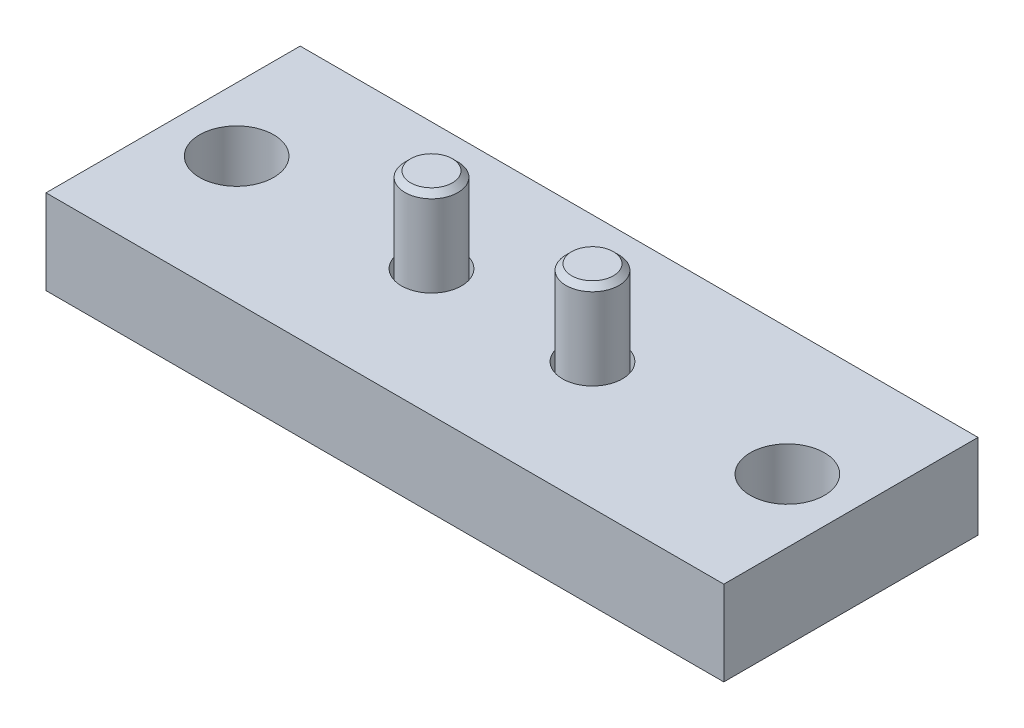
ISO-10303-21;
HEADER;
FILE_DESCRIPTION(('STEP AP214'),'2;1');
FILE_NAME('part.step','',(''),(''),'','','');
FILE_SCHEMA(('AUTOMOTIVE_DESIGN { 1 0 10303 214 1 1 1 1 }'));
ENDSEC;
DATA;
#1=APPLICATION_CONTEXT('core data for automotive mechanical design processes');
#2=APPLICATION_PROTOCOL_DEFINITION('international standard','automotive_design',2000,#1);
#3=PRODUCT_CONTEXT('',#1,'mechanical');
#4=PRODUCT('Part','Part','',(#3));
#5=PRODUCT_RELATED_PRODUCT_CATEGORY('part','',(#4));
#6=PRODUCT_DEFINITION_FORMATION('','',#4);
#7=PRODUCT_DEFINITION_CONTEXT('part definition',#1,'design');
#8=PRODUCT_DEFINITION('design','',#6,#7);
#9=PRODUCT_DEFINITION_SHAPE('','',#8);
#10=(LENGTH_UNIT() NAMED_UNIT(*) SI_UNIT(.MILLI.,.METRE.));
#11=(NAMED_UNIT(*) PLANE_ANGLE_UNIT() SI_UNIT($,.RADIAN.));
#12=(NAMED_UNIT(*) SI_UNIT($,.STERADIAN.) SOLID_ANGLE_UNIT());
#13=UNCERTAINTY_MEASURE_WITH_UNIT(LENGTH_MEASURE(1.E-05),#10,'distance_accuracy_value','');
#14=(GEOMETRIC_REPRESENTATION_CONTEXT(3) GLOBAL_UNCERTAINTY_ASSIGNED_CONTEXT((#13)) GLOBAL_UNIT_ASSIGNED_CONTEXT((#10,
#11,#12)) REPRESENTATION_CONTEXT('',''));
#15=CARTESIAN_POINT('',(0.,0.,0.));
#16=DIRECTION('',(0.,0.,1.));
#17=DIRECTION('',(1.,0.,0.));
#18=AXIS2_PLACEMENT_3D('',#15,#16,#17);
#19=CARTESIAN_POINT('',(8.93572,12.7,0.));
#20=DIRECTION('',(0.,1.,0.));
#21=DIRECTION('',(0.,0.,-1.));
#22=AXIS2_PLACEMENT_3D('',#19,#20,#21);
#23=PLANE('',#22);
#24=CARTESIAN_POINT('',(12.065,12.7,0.));
#25=DIRECTION('',(0.,-1.,0.));
#26=DIRECTION('',(0.,0.,1.));
#27=AXIS2_PLACEMENT_3D('',#24,#25,#26);
#28=CIRCLE('',#27,3.12928);
#29=CARTESIAN_POINT('',(12.065,12.7,3.12928));
#30=VERTEX_POINT('',#29);
#31=EDGE_CURVE('E321',#30,#30,#28,.T.);
#32=ORIENTED_EDGE('',*,*,#31,.F.);
#33=EDGE_LOOP('',(#32));
#34=FACE_BOUND('',#33,.T.);
#35=ADVANCED_FACE('F14',(#34),#23,.T.);
#36=CARTESIAN_POINT('',(12.065,12.7,0.));
#37=DIRECTION('',(0.,-1.,0.));
#38=DIRECTION('',(0.,0.,1.));
#39=AXIS2_PLACEMENT_3D('',#36,#37,#38);
#40=CONICAL_SURFACE('',#39,3.12928,0.785398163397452);
#41=CARTESIAN_POINT('',(12.065,11.86053,0.));
#42=DIRECTION('',(0.,-1.,0.));
#43=DIRECTION('',(0.,0.,1.));
#44=AXIS2_PLACEMENT_3D('',#41,#42,#43);
#45=CIRCLE('',#44,3.96875);
#46=CARTESIAN_POINT('',(12.065,11.86053,3.96875));
#47=VERTEX_POINT('',#46);
#48=EDGE_CURVE('E325',#47,#47,#45,.T.);
#49=ORIENTED_EDGE('',*,*,#48,.F.);
#50=EDGE_LOOP('',(#49));
#51=FACE_BOUND('',#50,.T.);
#52=ORIENTED_EDGE('',*,*,#31,.T.);
#53=EDGE_LOOP('',(#52));
#54=FACE_BOUND('',#53,.T.);
#55=ADVANCED_FACE('F410',(#51,#54),#40,.T.);
#56=CARTESIAN_POINT('',(12.065,-12.7,0.));
#57=DIRECTION('',(0.,-1.,0.));
#58=DIRECTION('',(0.,0.,1.));
#59=AXIS2_PLACEMENT_3D('',#56,#57,#58);
#60=CYLINDRICAL_SURFACE('',#59,3.96875);
#61=ORIENTED_EDGE('',*,*,#48,.T.);
#62=EDGE_LOOP('',(#61));
#63=FACE_BOUND('',#62,.T.);
#64=CARTESIAN_POINT('',(12.065,-7.55457534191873,0.));
#65=DIRECTION('',(0.,-1.,0.));
#66=DIRECTION('',(0.,0.,1.));
#67=AXIS2_PLACEMENT_3D('',#64,#65,#66);
#68=CIRCLE('',#67,3.96875);
#69=CARTESIAN_POINT('',(12.065,-7.55457534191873,3.96875));
#70=VERTEX_POINT('',#69);
#71=EDGE_CURVE('E328',#70,#70,#68,.T.);
#72=ORIENTED_EDGE('',*,*,#71,.F.);
#73=EDGE_LOOP('',(#72));
#74=FACE_BOUND('',#73,.T.);
#75=ADVANCED_FACE('F400',(#63,#74),#60,.T.);
#76=CARTESIAN_POINT('',(12.065,-12.573,0.));
#77=DIRECTION('',(0.,-1.,0.));
#78=DIRECTION('',(0.,0.,1.));
#79=AXIS2_PLACEMENT_3D('',#76,#77,#78);
#80=CONICAL_SURFACE('',#79,8.3312,0.715584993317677);
#81=ORIENTED_EDGE('',*,*,#71,.T.);
#82=EDGE_LOOP('',(#81));
#83=FACE_BOUND('',#82,.T.);
#84=CARTESIAN_POINT('',(12.065,-8.16087701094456,0.));
#85=DIRECTION('',(0.,-1.,0.));
#86=DIRECTION('',(0.,0.,-1.));
#87=AXIS2_PLACEMENT_3D('',#84,#85,#86);
#88=CIRCLE('',#87,4.4958);
#89=CARTESIAN_POINT('',(12.065,-8.16087701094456,-4.4958));
#90=VERTEX_POINT('',#89);
#91=EDGE_CURVE('E340',#90,#90,#88,.T.);
#92=ORIENTED_EDGE('',*,*,#91,.F.);
#93=EDGE_LOOP('',(#92));
#94=FACE_BOUND('',#93,.T.);
#95=ADVANCED_FACE('F397',(#83,#94),#80,.T.);
#96=CARTESIAN_POINT('',(12.065,-12.573,0.));
#97=DIRECTION('',(0.,-1.,0.));
#98=DIRECTION('',(0.,0.,1.));
#99=AXIS2_PLACEMENT_3D('',#96,#97,#98);
#100=CIRCLE('',#99,8.3312);
#101=CARTESIAN_POINT('',(12.065,-12.573,8.3312));
#102=VERTEX_POINT('',#101);
#103=EDGE_CURVE('E331',#102,#102,#100,.T.);
#104=ORIENTED_EDGE('',*,*,#103,.F.);
#105=EDGE_LOOP('',(#104));
#106=FACE_BOUND('',#105,.T.);
#107=CARTESIAN_POINT('',(12.065,-10.1007752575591,0.));
#108=DIRECTION('',(0.,1.,0.));
#109=DIRECTION('',(0.,0.,1.));
#110=AXIS2_PLACEMENT_3D('',#107,#108,#109);
#111=CIRCLE('',#110,6.18212781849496);
#112=CARTESIAN_POINT('',(12.065,-10.1007752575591,6.18212781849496));
#113=VERTEX_POINT('',#112);
#114=EDGE_CURVE('E338',#113,#113,#111,.T.);
#115=ORIENTED_EDGE('',*,*,#114,.F.);
#116=EDGE_LOOP('',(#115));
#117=FACE_BOUND('',#116,.T.);
#118=ADVANCED_FACE('F399',(#106,#117),#80,.T.);
#119=CARTESIAN_POINT('',(12.065,-12.7,0.));
#120=DIRECTION('',(0.,-1.,0.));
#121=DIRECTION('',(0.,0.,1.));
#122=AXIS2_PLACEMENT_3D('',#119,#120,#121);
#123=PLANE('',#122);
#124=CARTESIAN_POINT('',(12.065,-12.7,0.));
#125=DIRECTION('',(0.,-1.,0.));
#126=DIRECTION('',(0.,0.,1.));
#127=AXIS2_PLACEMENT_3D('',#124,#125,#126);
#128=CIRCLE('',#127,8.3312);
#129=CARTESIAN_POINT('',(12.065,-12.7,8.3312));
#130=VERTEX_POINT('',#129);
#131=EDGE_CURVE('E334',#130,#130,#128,.T.);
#132=ORIENTED_EDGE('',*,*,#131,.T.);
#133=EDGE_LOOP('',(#132));
#134=FACE_BOUND('',#133,.T.);
#135=DIRECTION('',(0.5,0.,-0.86602540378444));
#136=VECTOR('',#135,1.);
#137=CARTESIAN_POINT('',(13.4398153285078,-12.7,2.38125));
#138=LINE('',#137,#136);
#139=CARTESIAN_POINT('',(13.4398153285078,-12.7,2.38125));
#140=VERTEX_POINT('',#139);
#141=CARTESIAN_POINT('',(14.8146306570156,-12.7,0.));
#142=VERTEX_POINT('',#141);
#143=EDGE_CURVE('E273',#140,#142,#138,.T.);
#144=ORIENTED_EDGE('',*,*,#143,.T.);
#145=DIRECTION('',(-0.5,0.,-0.86602540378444));
#146=VECTOR('',#145,1.);
#147=CARTESIAN_POINT('',(14.8146306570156,-12.7,0.));
#148=LINE('',#147,#146);
#149=CARTESIAN_POINT('',(13.4398153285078,-12.7,-2.38125));
#150=VERTEX_POINT('',#149);
#151=EDGE_CURVE('E258',#142,#150,#148,.T.);
#152=ORIENTED_EDGE('',*,*,#151,.T.);
#153=DIRECTION('',(-1.,0.,0.));
#154=VECTOR('',#153,1.);
#155=CARTESIAN_POINT('',(13.4398153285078,-12.7,-2.38125));
#156=LINE('',#155,#154);
#157=CARTESIAN_POINT('',(10.6901846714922,-12.7,-2.38125));
#158=VERTEX_POINT('',#157);
#159=EDGE_CURVE('E261',#150,#158,#156,.T.);
#160=ORIENTED_EDGE('',*,*,#159,.T.);
#161=DIRECTION('',(-0.5,0.,0.866025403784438));
#162=VECTOR('',#161,1.);
#163=CARTESIAN_POINT('',(10.6901846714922,-12.7,-2.38125));
#164=LINE('',#163,#162);
#165=CARTESIAN_POINT('',(9.3153693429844,-12.7,0.));
#166=VERTEX_POINT('',#165);
#167=EDGE_CURVE('E264',#158,#166,#164,.T.);
#168=ORIENTED_EDGE('',*,*,#167,.T.);
#169=DIRECTION('',(0.5,0.,0.866025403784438));
#170=VECTOR('',#169,1.);
#171=CARTESIAN_POINT('',(9.3153693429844,-12.7,0.));
#172=LINE('',#171,#170);
#173=CARTESIAN_POINT('',(10.6901846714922,-12.7,2.38125));
#174=VERTEX_POINT('',#173);
#175=EDGE_CURVE('E267',#166,#174,#172,.T.);
#176=ORIENTED_EDGE('',*,*,#175,.T.);
#177=DIRECTION('',(1.,0.,0.));
#178=VECTOR('',#177,1.);
#179=CARTESIAN_POINT('',(10.6901846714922,-12.7,2.38125));
#180=LINE('',#179,#178);
#181=EDGE_CURVE('E270',#174,#140,#180,.T.);
#182=ORIENTED_EDGE('',*,*,#181,.T.);
#183=EDGE_LOOP('',(#144,#152,#160,#168,#176,#182));
#184=FACE_BOUND('',#183,.T.);
#185=ADVANCED_FACE('F408',(#134,#184),#123,.T.);
#186=CARTESIAN_POINT('',(12.065,-12.7,0.));
#187=DIRECTION('',(0.,-1.,0.));
#188=DIRECTION('',(0.,0.,1.));
#189=AXIS2_PLACEMENT_3D('',#186,#187,#188);
#190=CYLINDRICAL_SURFACE('',#189,8.3312);
#191=ORIENTED_EDGE('',*,*,#103,.T.);
#192=EDGE_LOOP('',(#191));
#193=FACE_BOUND('',#192,.T.);
#194=ORIENTED_EDGE('',*,*,#131,.F.);
#195=EDGE_LOOP('',(#194));
#196=FACE_BOUND('',#195,.T.);
#197=ADVANCED_FACE('F464',(#193,#196),#190,.T.);
#198=CARTESIAN_POINT('',(14.8146306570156,-9.271,0.));
#199=DIRECTION('',(-0.86602540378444,0.,0.5));
#200=DIRECTION('',(0.5,0.,0.86602540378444));
#201=AXIS2_PLACEMENT_3D('',#198,#199,#200);
#202=PLANE('',#201);
#203=ORIENTED_EDGE('',*,*,#151,.F.);
#204=DIRECTION('',(0.,-1.,0.));
#205=VECTOR('',#204,1.);
#206=CARTESIAN_POINT('',(14.8146306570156,-9.271,0.));
#207=LINE('',#206,#205);
#208=CARTESIAN_POINT('',(14.8146306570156,-9.271,0.));
#209=VERTEX_POINT('',#208);
#210=EDGE_CURVE('E299',#209,#142,#207,.T.);
#211=ORIENTED_EDGE('',*,*,#210,.F.);
#212=DIRECTION('',(-0.5,0.,-0.86602540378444));
#213=VECTOR('',#212,1.);
#214=CARTESIAN_POINT('',(14.8146306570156,-9.271,0.));
#215=LINE('',#214,#213);
#216=CARTESIAN_POINT('',(14.1272229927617,-9.271,-1.190625));
#217=VERTEX_POINT('',#216);
#218=EDGE_CURVE('E277',#209,#217,#215,.T.);
#219=ORIENTED_EDGE('',*,*,#218,.T.);
#220=CARTESIAN_POINT('',(13.4398153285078,-9.271,-2.38125));
#221=VERTEX_POINT('',#220);
#222=EDGE_CURVE('E276',#217,#221,#215,.T.);
#223=ORIENTED_EDGE('',*,*,#222,.T.);
#224=DIRECTION('',(0.,-1.,0.));
#225=VECTOR('',#224,1.);
#226=CARTESIAN_POINT('',(13.4398153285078,-9.271,-2.38125));
#227=LINE('',#226,#225);
#228=EDGE_CURVE('E314',#221,#150,#227,.T.);
#229=ORIENTED_EDGE('',*,*,#228,.T.);
#230=EDGE_LOOP('',(#203,#211,#219,#223,#229));
#231=FACE_BOUND('',#230,.T.);
#232=ADVANCED_FACE('F467',(#231),#202,.T.);
#233=CARTESIAN_POINT('',(13.4398153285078,-9.271,-2.38125));
#234=DIRECTION('',(0.,0.,1.));
#235=DIRECTION('',(0.,1.,0.));
#236=AXIS2_PLACEMENT_3D('',#233,#234,#235);
#237=PLANE('',#236);
#238=ORIENTED_EDGE('',*,*,#159,.F.);
#239=ORIENTED_EDGE('',*,*,#228,.F.);
#240=DIRECTION('',(-1.,0.,0.));
#241=VECTOR('',#240,1.);
#242=CARTESIAN_POINT('',(13.4398153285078,-9.271,-2.38125));
#243=LINE('',#242,#241);
#244=CARTESIAN_POINT('',(12.065,-9.271,-2.38125));
#245=VERTEX_POINT('',#244);
#246=EDGE_CURVE('E281',#221,#245,#243,.T.);
#247=ORIENTED_EDGE('',*,*,#246,.T.);
#248=CARTESIAN_POINT('',(10.6901846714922,-9.271,-2.38125));
#249=VERTEX_POINT('',#248);
#250=EDGE_CURVE('E280',#245,#249,#243,.T.);
#251=ORIENTED_EDGE('',*,*,#250,.T.);
#252=DIRECTION('',(0.,-1.,0.));
#253=VECTOR('',#252,1.);
#254=CARTESIAN_POINT('',(10.6901846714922,-9.271,-2.38125));
#255=LINE('',#254,#253);
#256=EDGE_CURVE('E311',#249,#158,#255,.T.);
#257=ORIENTED_EDGE('',*,*,#256,.T.);
#258=EDGE_LOOP('',(#238,#239,#247,#251,#257));
#259=FACE_BOUND('',#258,.T.);
#260=ADVANCED_FACE('F472',(#259),#237,.T.);
#261=CARTESIAN_POINT('',(10.6901846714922,-9.271,-2.38125));
#262=DIRECTION('',(0.866025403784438,0.,0.5));
#263=DIRECTION('',(0.5,0.,-0.866025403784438));
#264=AXIS2_PLACEMENT_3D('',#261,#262,#263);
#265=PLANE('',#264);
#266=ORIENTED_EDGE('',*,*,#167,.F.);
#267=ORIENTED_EDGE('',*,*,#256,.F.);
#268=DIRECTION('',(-0.5,0.,0.866025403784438));
#269=VECTOR('',#268,1.);
#270=CARTESIAN_POINT('',(10.6901846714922,-9.271,-2.38125));
#271=LINE('',#270,#269);
#272=CARTESIAN_POINT('',(10.0027770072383,-9.271,-1.190625));
#273=VERTEX_POINT('',#272);
#274=EDGE_CURVE('E284',#249,#273,#271,.T.);
#275=ORIENTED_EDGE('',*,*,#274,.T.);
#276=CARTESIAN_POINT('',(9.3153693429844,-9.271,0.));
#277=VERTEX_POINT('',#276);
#278=EDGE_CURVE('E283',#273,#277,#271,.T.);
#279=ORIENTED_EDGE('',*,*,#278,.T.);
#280=DIRECTION('',(0.,-1.,0.));
#281=VECTOR('',#280,1.);
#282=CARTESIAN_POINT('',(9.3153693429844,-9.271,0.));
#283=LINE('',#282,#281);
#284=EDGE_CURVE('E308',#277,#166,#283,.T.);
#285=ORIENTED_EDGE('',*,*,#284,.T.);
#286=EDGE_LOOP('',(#266,#267,#275,#279,#285));
#287=FACE_BOUND('',#286,.T.);
#288=ADVANCED_FACE('F517',(#287),#265,.T.);
#289=CARTESIAN_POINT('',(9.3153693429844,-9.271,0.));
#290=DIRECTION('',(0.866025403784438,0.,-0.5));
#291=DIRECTION('',(-0.5,0.,-0.866025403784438));
#292=AXIS2_PLACEMENT_3D('',#289,#290,#291);
#293=PLANE('',#292);
#294=ORIENTED_EDGE('',*,*,#175,.F.);
#295=ORIENTED_EDGE('',*,*,#284,.F.);
#296=DIRECTION('',(0.5,0.,0.866025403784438));
#297=VECTOR('',#296,1.);
#298=CARTESIAN_POINT('',(9.3153693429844,-9.271,0.));
#299=LINE('',#298,#297);
#300=CARTESIAN_POINT('',(10.0027770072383,-9.271,1.190625));
#301=VERTEX_POINT('',#300);
#302=EDGE_CURVE('E288',#277,#301,#299,.T.);
#303=ORIENTED_EDGE('',*,*,#302,.T.);
#304=CARTESIAN_POINT('',(10.6901846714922,-9.271,2.38125));
#305=VERTEX_POINT('',#304);
#306=EDGE_CURVE('E287',#301,#305,#299,.T.);
#307=ORIENTED_EDGE('',*,*,#306,.T.);
#308=DIRECTION('',(0.,-1.,0.));
#309=VECTOR('',#308,1.);
#310=CARTESIAN_POINT('',(10.6901846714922,-9.271,2.38125));
#311=LINE('',#310,#309);
#312=EDGE_CURVE('E305',#305,#174,#311,.T.);
#313=ORIENTED_EDGE('',*,*,#312,.T.);
#314=EDGE_LOOP('',(#294,#295,#303,#307,#313));
#315=FACE_BOUND('',#314,.T.);
#316=ADVANCED_FACE('F515',(#315),#293,.T.);
#317=CARTESIAN_POINT('',(10.6901846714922,-9.271,2.38125));
#318=DIRECTION('',(0.,0.,-1.));
#319=DIRECTION('',(-1.,0.,0.));
#320=AXIS2_PLACEMENT_3D('',#317,#318,#319);
#321=PLANE('',#320);
#322=ORIENTED_EDGE('',*,*,#181,.F.);
#323=ORIENTED_EDGE('',*,*,#312,.F.);
#324=DIRECTION('',(1.,0.,0.));
#325=VECTOR('',#324,1.);
#326=CARTESIAN_POINT('',(10.6901846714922,-9.271,2.38125));
#327=LINE('',#326,#325);
#328=CARTESIAN_POINT('',(12.065,-9.271,2.38125));
#329=VERTEX_POINT('',#328);
#330=EDGE_CURVE('E292',#305,#329,#327,.T.);
#331=ORIENTED_EDGE('',*,*,#330,.T.);
#332=CARTESIAN_POINT('',(13.4398153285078,-9.271,2.38125));
#333=VERTEX_POINT('',#332);
#334=EDGE_CURVE('E291',#329,#333,#327,.T.);
#335=ORIENTED_EDGE('',*,*,#334,.T.);
#336=DIRECTION('',(0.,-1.,0.));
#337=VECTOR('',#336,1.);
#338=CARTESIAN_POINT('',(13.4398153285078,-9.271,2.38125));
#339=LINE('',#338,#337);
#340=EDGE_CURVE('E302',#333,#140,#339,.T.);
#341=ORIENTED_EDGE('',*,*,#340,.T.);
#342=EDGE_LOOP('',(#322,#323,#331,#335,#341));
#343=FACE_BOUND('',#342,.T.);
#344=ADVANCED_FACE('F485',(#343),#321,.T.);
#345=CARTESIAN_POINT('',(13.4398153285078,-9.271,2.38125));
#346=DIRECTION('',(-0.86602540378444,0.,-0.5));
#347=DIRECTION('',(-0.5,0.,0.86602540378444));
#348=AXIS2_PLACEMENT_3D('',#345,#346,#347);
#349=PLANE('',#348);
#350=ORIENTED_EDGE('',*,*,#143,.F.);
#351=ORIENTED_EDGE('',*,*,#340,.F.);
#352=DIRECTION('',(0.5,0.,-0.86602540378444));
#353=VECTOR('',#352,1.);
#354=CARTESIAN_POINT('',(13.4398153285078,-9.271,2.38125));
#355=LINE('',#354,#353);
#356=CARTESIAN_POINT('',(14.1272229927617,-9.271,1.190625));
#357=VERTEX_POINT('',#356);
#358=EDGE_CURVE('E296',#333,#357,#355,.T.);
#359=ORIENTED_EDGE('',*,*,#358,.T.);
#360=EDGE_CURVE('E295',#357,#209,#355,.T.);
#361=ORIENTED_EDGE('',*,*,#360,.T.);
#362=ORIENTED_EDGE('',*,*,#210,.T.);
#363=EDGE_LOOP('',(#350,#351,#359,#361,#362));
#364=FACE_BOUND('',#363,.T.);
#365=ADVANCED_FACE('F481',(#364),#349,.T.);
#366=CARTESIAN_POINT('',(13.4398153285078,-9.271,-2.38125));
#367=DIRECTION('',(0.,1.,0.));
#368=DIRECTION('',(0.,0.,-1.));
#369=AXIS2_PLACEMENT_3D('',#366,#367,#368);
#370=PLANE('',#369);
#371=ORIENTED_EDGE('',*,*,#246,.F.);
#372=ORIENTED_EDGE('',*,*,#222,.F.);
#373=CARTESIAN_POINT('',(12.065,-9.271,0.));
#374=DIRECTION('',(0.,-1.,0.));
#375=DIRECTION('',(0.,0.,1.));
#376=AXIS2_PLACEMENT_3D('',#373,#374,#375);
#377=CIRCLE('',#376,2.38125);
#378=EDGE_CURVE('E500',#245,#217,#377,.T.);
#379=ORIENTED_EDGE('',*,*,#378,.F.);
#380=EDGE_LOOP('',(#371,#372,#379));
#381=FACE_BOUND('',#380,.T.);
#382=ADVANCED_FACE('F523',(#381),#370,.F.);
#383=ORIENTED_EDGE('',*,*,#218,.F.);
#384=ORIENTED_EDGE('',*,*,#360,.F.);
#385=EDGE_CURVE('E496',#217,#357,#377,.T.);
#386=ORIENTED_EDGE('',*,*,#385,.F.);
#387=EDGE_LOOP('',(#383,#384,#386));
#388=FACE_BOUND('',#387,.T.);
#389=ADVANCED_FACE('F540',(#388),#370,.F.);
#390=ORIENTED_EDGE('',*,*,#358,.F.);
#391=ORIENTED_EDGE('',*,*,#334,.F.);
#392=EDGE_CURVE('E317',#357,#329,#377,.T.);
#393=ORIENTED_EDGE('',*,*,#392,.F.);
#394=EDGE_LOOP('',(#390,#391,#393));
#395=FACE_BOUND('',#394,.T.);
#396=ADVANCED_FACE('F491',(#395),#370,.F.);
#397=ORIENTED_EDGE('',*,*,#330,.F.);
#398=ORIENTED_EDGE('',*,*,#306,.F.);
#399=EDGE_CURVE('E318',#329,#301,#377,.T.);
#400=ORIENTED_EDGE('',*,*,#399,.F.);
#401=EDGE_LOOP('',(#397,#398,#400));
#402=FACE_BOUND('',#401,.T.);
#403=ADVANCED_FACE('F512',(#402),#370,.F.);
#404=ORIENTED_EDGE('',*,*,#302,.F.);
#405=ORIENTED_EDGE('',*,*,#278,.F.);
#406=EDGE_CURVE('E322',#301,#273,#377,.T.);
#407=ORIENTED_EDGE('',*,*,#406,.F.);
#408=EDGE_LOOP('',(#404,#405,#407));
#409=FACE_BOUND('',#408,.T.);
#410=ADVANCED_FACE('F510',(#409),#370,.F.);
#411=ORIENTED_EDGE('',*,*,#274,.F.);
#412=ORIENTED_EDGE('',*,*,#250,.F.);
#413=EDGE_CURVE('E504',#273,#245,#377,.T.);
#414=ORIENTED_EDGE('',*,*,#413,.F.);
#415=EDGE_LOOP('',(#411,#412,#414));
#416=FACE_BOUND('',#415,.T.);
#417=ADVANCED_FACE('F527',(#416),#370,.F.);
#418=CARTESIAN_POINT('',(12.065,-9.271,0.));
#419=DIRECTION('',(0.,-1.,0.));
#420=DIRECTION('',(0.,0.,1.));
#421=AXIS2_PLACEMENT_3D('',#418,#419,#420);
#422=CONICAL_SURFACE('',#421,2.38125,1.0471975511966);
#423=CARTESIAN_POINT('',(12.065,-7.89618467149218,0.));
#424=VERTEX_POINT('',#423);
#425=VERTEX_LOOP('',#424);
#426=FACE_BOUND('',#425,.T.);
#427=ORIENTED_EDGE('',*,*,#399,.T.);
#428=ORIENTED_EDGE('',*,*,#406,.T.);
#429=ORIENTED_EDGE('',*,*,#413,.T.);
#430=ORIENTED_EDGE('',*,*,#378,.T.);
#431=ORIENTED_EDGE('',*,*,#385,.T.);
#432=ORIENTED_EDGE('',*,*,#392,.T.);
#433=EDGE_LOOP('',(#427,#428,#429,#430,#431,#432));
#434=FACE_BOUND('',#433,.T.);
#435=ADVANCED_FACE('F497',(#426,#434),#422,.F.);
#436=CARTESIAN_POINT('',(-15.19428,12.7,0.));
#437=DIRECTION('',(0.,1.,0.));
#438=DIRECTION('',(0.,0.,-1.));
#439=AXIS2_PLACEMENT_3D('',#436,#437,#438);
#440=PLANE('',#439);
#441=CARTESIAN_POINT('',(-12.065,12.7,0.));
#442=DIRECTION('',(0.,-1.,0.));
#443=DIRECTION('',(0.,0.,1.));
#444=AXIS2_PLACEMENT_3D('',#441,#442,#443);
#445=CIRCLE('',#444,3.12928);
#446=CARTESIAN_POINT('',(-12.065,12.7,3.12928));
#447=VERTEX_POINT('',#446);
#448=EDGE_CURVE('E242',#447,#447,#445,.T.);
#449=ORIENTED_EDGE('',*,*,#448,.F.);
#450=EDGE_LOOP('',(#449));
#451=FACE_BOUND('',#450,.T.);
#452=ADVANCED_FACE('F534',(#451),#440,.T.);
#453=CARTESIAN_POINT('',(-12.065,12.7,0.));
#454=DIRECTION('',(0.,-1.,0.));
#455=DIRECTION('',(0.,0.,1.));
#456=AXIS2_PLACEMENT_3D('',#453,#454,#455);
#457=CONICAL_SURFACE('',#456,3.12928,0.785398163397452);
#458=CARTESIAN_POINT('',(-12.065,11.86053,0.));
#459=DIRECTION('',(0.,-1.,0.));
#460=DIRECTION('',(0.,0.,1.));
#461=AXIS2_PLACEMENT_3D('',#458,#459,#460);
#462=CIRCLE('',#461,3.96875);
#463=CARTESIAN_POINT('',(-12.065,11.86053,3.96875));
#464=VERTEX_POINT('',#463);
#465=EDGE_CURVE('E246',#464,#464,#462,.T.);
#466=ORIENTED_EDGE('',*,*,#465,.F.);
#467=EDGE_LOOP('',(#466));
#468=FACE_BOUND('',#467,.T.);
#469=ORIENTED_EDGE('',*,*,#448,.T.);
#470=EDGE_LOOP('',(#469));
#471=FACE_BOUND('',#470,.T.);
#472=ADVANCED_FACE('F700',(#468,#471),#457,.T.);
#473=CARTESIAN_POINT('',(-12.065,-12.7,0.));
#474=DIRECTION('',(0.,-1.,0.));
#475=DIRECTION('',(0.,0.,1.));
#476=AXIS2_PLACEMENT_3D('',#473,#474,#475);
#477=CYLINDRICAL_SURFACE('',#476,3.96875);
#478=ORIENTED_EDGE('',*,*,#465,.T.);
#479=EDGE_LOOP('',(#478));
#480=FACE_BOUND('',#479,.T.);
#481=CARTESIAN_POINT('',(-12.065,-7.55457534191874,0.));
#482=DIRECTION('',(0.,-1.,0.));
#483=DIRECTION('',(0.,0.,1.));
#484=AXIS2_PLACEMENT_3D('',#481,#482,#483);
#485=CIRCLE('',#484,3.96875);
#486=CARTESIAN_POINT('',(-12.065,-7.55457534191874,3.96875));
#487=VERTEX_POINT('',#486);
#488=EDGE_CURVE('E249',#487,#487,#485,.T.);
#489=ORIENTED_EDGE('',*,*,#488,.F.);
#490=EDGE_LOOP('',(#489));
#491=FACE_BOUND('',#490,.T.);
#492=ADVANCED_FACE('F711',(#480,#491),#477,.T.);
#493=CARTESIAN_POINT('',(-12.065,-12.573,0.));
#494=DIRECTION('',(0.,-1.,0.));
#495=DIRECTION('',(0.,0.,1.));
#496=AXIS2_PLACEMENT_3D('',#493,#494,#495);
#497=CONICAL_SURFACE('',#496,8.3312,0.715584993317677);
#498=ORIENTED_EDGE('',*,*,#488,.T.);
#499=EDGE_LOOP('',(#498));
#500=FACE_BOUND('',#499,.T.);
#501=CARTESIAN_POINT('',(-12.065,-8.16087701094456,0.));
#502=DIRECTION('',(0.,-1.,0.));
#503=DIRECTION('',(0.,0.,-1.));
#504=AXIS2_PLACEMENT_3D('',#501,#502,#503);
#505=CIRCLE('',#504,4.4958);
#506=CARTESIAN_POINT('',(-12.065,-8.16087701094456,-4.4958));
#507=VERTEX_POINT('',#506);
#508=EDGE_CURVE('E18',#507,#507,#505,.T.);
#509=ORIENTED_EDGE('',*,*,#508,.F.);
#510=EDGE_LOOP('',(#509));
#511=FACE_BOUND('',#510,.T.);
#512=ADVANCED_FACE('F722',(#500,#511),#497,.T.);
#513=CARTESIAN_POINT('',(-12.065,-12.573,0.));
#514=DIRECTION('',(0.,-1.,0.));
#515=DIRECTION('',(0.,0.,1.));
#516=AXIS2_PLACEMENT_3D('',#513,#514,#515);
#517=CIRCLE('',#516,8.3312);
#518=CARTESIAN_POINT('',(-12.065,-12.573,8.3312));
#519=VERTEX_POINT('',#518);
#520=EDGE_CURVE('E252',#519,#519,#517,.T.);
#521=ORIENTED_EDGE('',*,*,#520,.F.);
#522=EDGE_LOOP('',(#521));
#523=FACE_BOUND('',#522,.T.);
#524=CARTESIAN_POINT('',(-12.065,-10.100775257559,0.));
#525=DIRECTION('',(0.,1.,0.));
#526=DIRECTION('',(0.,0.,1.));
#527=AXIS2_PLACEMENT_3D('',#524,#525,#526);
#528=CIRCLE('',#527,6.18212781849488);
#529=CARTESIAN_POINT('',(-12.065,-10.100775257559,6.18212781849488));
#530=VERTEX_POINT('',#529);
#531=EDGE_CURVE('E9',#530,#530,#528,.T.);
#532=ORIENTED_EDGE('',*,*,#531,.F.);
#533=EDGE_LOOP('',(#532));
#534=FACE_BOUND('',#533,.T.);
#535=ADVANCED_FACE('F733',(#523,#534),#497,.T.);
#536=CARTESIAN_POINT('',(-12.065,-12.7,0.));
#537=DIRECTION('',(0.,-1.,0.));
#538=DIRECTION('',(0.,0.,1.));
#539=AXIS2_PLACEMENT_3D('',#536,#537,#538);
#540=PLANE('',#539);
#541=CARTESIAN_POINT('',(-12.065,-12.7,0.));
#542=DIRECTION('',(0.,-1.,0.));
#543=DIRECTION('',(0.,0.,1.));
#544=AXIS2_PLACEMENT_3D('',#541,#542,#543);
#545=CIRCLE('',#544,8.3312);
#546=CARTESIAN_POINT('',(-12.065,-12.7,8.3312));
#547=VERTEX_POINT('',#546);
#548=EDGE_CURVE('E255',#547,#547,#545,.T.);
#549=ORIENTED_EDGE('',*,*,#548,.T.);
#550=EDGE_LOOP('',(#549));
#551=FACE_BOUND('',#550,.T.);
#552=DIRECTION('',(0.5,0.,-0.86602540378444));
#553=VECTOR('',#552,1.);
#554=CARTESIAN_POINT('',(-10.6901846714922,-12.7,2.38125));
#555=LINE('',#554,#553);
#556=CARTESIAN_POINT('',(-10.6901846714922,-12.7,2.38125));
#557=VERTEX_POINT('',#556);
#558=CARTESIAN_POINT('',(-9.31536934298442,-12.7,0.));
#559=VERTEX_POINT('',#558);
#560=EDGE_CURVE('E196',#557,#559,#555,.T.);
#561=ORIENTED_EDGE('',*,*,#560,.T.);
#562=DIRECTION('',(-0.5,0.,-0.86602540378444));
#563=VECTOR('',#562,1.);
#564=CARTESIAN_POINT('',(-9.31536934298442,-12.7,0.));
#565=LINE('',#564,#563);
#566=CARTESIAN_POINT('',(-10.6901846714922,-12.7,-2.38125));
#567=VERTEX_POINT('',#566);
#568=EDGE_CURVE('E181',#559,#567,#565,.T.);
#569=ORIENTED_EDGE('',*,*,#568,.T.);
#570=DIRECTION('',(-1.,0.,0.));
#571=VECTOR('',#570,1.);
#572=CARTESIAN_POINT('',(-10.6901846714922,-12.7,-2.38125));
#573=LINE('',#572,#571);
#574=CARTESIAN_POINT('',(-13.4398153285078,-12.7,-2.38125));
#575=VERTEX_POINT('',#574);
#576=EDGE_CURVE('E171',#567,#575,#573,.T.);
#577=ORIENTED_EDGE('',*,*,#576,.T.);
#578=DIRECTION('',(-0.5,0.,0.866025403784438));
#579=VECTOR('',#578,1.);
#580=CARTESIAN_POINT('',(-13.4398153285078,-12.7,-2.38125));
#581=LINE('',#580,#579);
#582=CARTESIAN_POINT('',(-14.8146306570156,-12.7,0.));
#583=VERTEX_POINT('',#582);
#584=EDGE_CURVE('E180',#575,#583,#581,.T.);
#585=ORIENTED_EDGE('',*,*,#584,.T.);
#586=DIRECTION('',(0.5,0.,0.866025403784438));
#587=VECTOR('',#586,1.);
#588=CARTESIAN_POINT('',(-14.8146306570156,-12.7,0.));
#589=LINE('',#588,#587);
#590=CARTESIAN_POINT('',(-13.4398153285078,-12.7,2.38125));
#591=VERTEX_POINT('',#590);
#592=EDGE_CURVE('E200',#583,#591,#589,.T.);
#593=ORIENTED_EDGE('',*,*,#592,.T.);
#594=DIRECTION('',(1.,0.,0.));
#595=VECTOR('',#594,1.);
#596=CARTESIAN_POINT('',(-13.4398153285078,-12.7,2.38125));
#597=LINE('',#596,#595);
#598=EDGE_CURVE('E203',#591,#557,#597,.T.);
#599=ORIENTED_EDGE('',*,*,#598,.T.);
#600=EDGE_LOOP('',(#561,#569,#577,#585,#593,#599));
#601=FACE_BOUND('',#600,.T.);
#602=ADVANCED_FACE('F194',(#551,#601),#540,.T.);
#603=CARTESIAN_POINT('',(-12.065,-12.7,0.));
#604=DIRECTION('',(0.,-1.,0.));
#605=DIRECTION('',(0.,0.,1.));
#606=AXIS2_PLACEMENT_3D('',#603,#604,#605);
#607=CYLINDRICAL_SURFACE('',#606,8.3312);
#608=ORIENTED_EDGE('',*,*,#520,.T.);
#609=EDGE_LOOP('',(#608));
#610=FACE_BOUND('',#609,.T.);
#611=ORIENTED_EDGE('',*,*,#548,.F.);
#612=EDGE_LOOP('',(#611));
#613=FACE_BOUND('',#612,.T.);
#614=ADVANCED_FACE('F753',(#610,#613),#607,.T.);
#615=CARTESIAN_POINT('',(-9.31536934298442,-9.271,0.));
#616=DIRECTION('',(-0.86602540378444,0.,0.5));
#617=DIRECTION('',(0.5,0.,0.86602540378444));
#618=AXIS2_PLACEMENT_3D('',#615,#616,#617);
#619=PLANE('',#618);
#620=ORIENTED_EDGE('',*,*,#568,.F.);
#621=DIRECTION('',(0.,-1.,0.));
#622=VECTOR('',#621,1.);
#623=CARTESIAN_POINT('',(-9.31536934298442,-9.271,0.));
#624=LINE('',#623,#622);
#625=CARTESIAN_POINT('',(-9.31536934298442,-9.271,0.));
#626=VERTEX_POINT('',#625);
#627=EDGE_CURVE('E227',#626,#559,#624,.T.);
#628=ORIENTED_EDGE('',*,*,#627,.F.);
#629=DIRECTION('',(-0.5,0.,-0.86602540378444));
#630=VECTOR('',#629,1.);
#631=CARTESIAN_POINT('',(-9.31536934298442,-9.271,0.));
#632=LINE('',#631,#630);
#633=CARTESIAN_POINT('',(-10.0027770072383,-9.271,-1.190625));
#634=VERTEX_POINT('',#633);
#635=EDGE_CURVE('E206',#626,#634,#632,.T.);
#636=ORIENTED_EDGE('',*,*,#635,.T.);
#637=CARTESIAN_POINT('',(-10.6901846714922,-9.271,-2.38125));
#638=VERTEX_POINT('',#637);
#639=EDGE_CURVE('E189',#634,#638,#632,.T.);
#640=ORIENTED_EDGE('',*,*,#639,.T.);
#641=DIRECTION('',(0.,-1.,0.));
#642=VECTOR('',#641,1.);
#643=CARTESIAN_POINT('',(-10.6901846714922,-9.271,-2.38125));
#644=LINE('',#643,#642);
#645=EDGE_CURVE('E174',#638,#567,#644,.T.);
#646=ORIENTED_EDGE('',*,*,#645,.T.);
#647=EDGE_LOOP('',(#620,#628,#636,#640,#646));
#648=FACE_BOUND('',#647,.T.);
#649=ADVANCED_FACE('F184',(#648),#619,.T.);
#650=CARTESIAN_POINT('',(-10.6901846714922,-9.271,-2.38125));
#651=DIRECTION('',(0.,0.,1.));
#652=DIRECTION('',(0.,1.,0.));
#653=AXIS2_PLACEMENT_3D('',#650,#651,#652);
#654=PLANE('',#653);
#655=ORIENTED_EDGE('',*,*,#576,.F.);
#656=ORIENTED_EDGE('',*,*,#645,.F.);
#657=DIRECTION('',(-1.,0.,0.));
#658=VECTOR('',#657,1.);
#659=CARTESIAN_POINT('',(-10.6901846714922,-9.271,-2.38125));
#660=LINE('',#659,#658);
#661=CARTESIAN_POINT('',(-12.065,-9.271,-2.38125));
#662=VERTEX_POINT('',#661);
#663=EDGE_CURVE('E209',#638,#662,#660,.T.);
#664=ORIENTED_EDGE('',*,*,#663,.T.);
#665=CARTESIAN_POINT('',(-13.4398153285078,-9.271,-2.38125));
#666=VERTEX_POINT('',#665);
#667=EDGE_CURVE('E208',#662,#666,#660,.T.);
#668=ORIENTED_EDGE('',*,*,#667,.T.);
#669=DIRECTION('',(0.,-1.,0.));
#670=VECTOR('',#669,1.);
#671=CARTESIAN_POINT('',(-13.4398153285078,-9.271,-2.38125));
#672=LINE('',#671,#670);
#673=EDGE_CURVE('E176',#666,#575,#672,.T.);
#674=ORIENTED_EDGE('',*,*,#673,.T.);
#675=EDGE_LOOP('',(#655,#656,#664,#668,#674));
#676=FACE_BOUND('',#675,.T.);
#677=ADVANCED_FACE('F173',(#676),#654,.T.);
#678=CARTESIAN_POINT('',(-13.4398153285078,-9.271,-2.38125));
#679=DIRECTION('',(0.866025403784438,0.,0.5));
#680=DIRECTION('',(0.5,0.,-0.866025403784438));
#681=AXIS2_PLACEMENT_3D('',#678,#679,#680);
#682=PLANE('',#681);
#683=ORIENTED_EDGE('',*,*,#584,.F.);
#684=ORIENTED_EDGE('',*,*,#673,.F.);
#685=DIRECTION('',(-0.5,0.,0.866025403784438));
#686=VECTOR('',#685,1.);
#687=CARTESIAN_POINT('',(-13.4398153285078,-9.271,-2.38125));
#688=LINE('',#687,#686);
#689=CARTESIAN_POINT('',(-14.1272229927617,-9.271,-1.190625));
#690=VERTEX_POINT('',#689);
#691=EDGE_CURVE('E212',#666,#690,#688,.T.);
#692=ORIENTED_EDGE('',*,*,#691,.T.);
#693=CARTESIAN_POINT('',(-14.8146306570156,-9.271,0.));
#694=VERTEX_POINT('',#693);
#695=EDGE_CURVE('E211',#690,#694,#688,.T.);
#696=ORIENTED_EDGE('',*,*,#695,.T.);
#697=DIRECTION('',(0.,-1.,0.));
#698=VECTOR('',#697,1.);
#699=CARTESIAN_POINT('',(-14.8146306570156,-9.271,0.));
#700=LINE('',#699,#698);
#701=EDGE_CURVE('E235',#694,#583,#700,.T.);
#702=ORIENTED_EDGE('',*,*,#701,.T.);
#703=EDGE_LOOP('',(#683,#684,#692,#696,#702));
#704=FACE_BOUND('',#703,.T.);
#705=ADVANCED_FACE('F782',(#704),#682,.T.);
#706=CARTESIAN_POINT('',(-14.8146306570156,-9.271,0.));
#707=DIRECTION('',(0.866025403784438,0.,-0.5));
#708=DIRECTION('',(-0.5,0.,-0.866025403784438));
#709=AXIS2_PLACEMENT_3D('',#706,#707,#708);
#710=PLANE('',#709);
#711=ORIENTED_EDGE('',*,*,#592,.F.);
#712=ORIENTED_EDGE('',*,*,#701,.F.);
#713=DIRECTION('',(0.5,0.,0.866025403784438));
#714=VECTOR('',#713,1.);
#715=CARTESIAN_POINT('',(-14.8146306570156,-9.271,0.));
#716=LINE('',#715,#714);
#717=CARTESIAN_POINT('',(-14.1272229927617,-9.271,1.190625));
#718=VERTEX_POINT('',#717);
#719=EDGE_CURVE('E216',#694,#718,#716,.T.);
#720=ORIENTED_EDGE('',*,*,#719,.T.);
#721=CARTESIAN_POINT('',(-13.4398153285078,-9.271,2.38125));
#722=VERTEX_POINT('',#721);
#723=EDGE_CURVE('E215',#718,#722,#716,.T.);
#724=ORIENTED_EDGE('',*,*,#723,.T.);
#725=DIRECTION('',(0.,-1.,0.));
#726=VECTOR('',#725,1.);
#727=CARTESIAN_POINT('',(-13.4398153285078,-9.271,2.38125));
#728=LINE('',#727,#726);
#729=EDGE_CURVE('E232',#722,#591,#728,.T.);
#730=ORIENTED_EDGE('',*,*,#729,.T.);
#731=EDGE_LOOP('',(#711,#712,#720,#724,#730));
#732=FACE_BOUND('',#731,.T.);
#733=ADVANCED_FACE('F792',(#732),#710,.T.);
#734=CARTESIAN_POINT('',(-13.4398153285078,-9.271,2.38125));
#735=DIRECTION('',(0.,0.,-1.));
#736=DIRECTION('',(-1.,0.,0.));
#737=AXIS2_PLACEMENT_3D('',#734,#735,#736);
#738=PLANE('',#737);
#739=ORIENTED_EDGE('',*,*,#598,.F.);
#740=ORIENTED_EDGE('',*,*,#729,.F.);
#741=DIRECTION('',(1.,0.,0.));
#742=VECTOR('',#741,1.);
#743=CARTESIAN_POINT('',(-13.4398153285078,-9.271,2.38125));
#744=LINE('',#743,#742);
#745=CARTESIAN_POINT('',(-12.065,-9.271,2.38125));
#746=VERTEX_POINT('',#745);
#747=EDGE_CURVE('E220',#722,#746,#744,.T.);
#748=ORIENTED_EDGE('',*,*,#747,.T.);
#749=CARTESIAN_POINT('',(-10.6901846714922,-9.271,2.38125));
#750=VERTEX_POINT('',#749);
#751=EDGE_CURVE('E219',#746,#750,#744,.T.);
#752=ORIENTED_EDGE('',*,*,#751,.T.);
#753=DIRECTION('',(0.,-1.,0.));
#754=VECTOR('',#753,1.);
#755=CARTESIAN_POINT('',(-10.6901846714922,-9.271,2.38125));
#756=LINE('',#755,#754);
#757=EDGE_CURVE('E229',#750,#557,#756,.T.);
#758=ORIENTED_EDGE('',*,*,#757,.T.);
#759=EDGE_LOOP('',(#739,#740,#748,#752,#758));
#760=FACE_BOUND('',#759,.T.);
#761=ADVANCED_FACE('F803',(#760),#738,.T.);
#762=CARTESIAN_POINT('',(-10.6901846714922,-9.271,2.38125));
#763=DIRECTION('',(-0.86602540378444,0.,-0.5));
#764=DIRECTION('',(-0.5,0.,0.86602540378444));
#765=AXIS2_PLACEMENT_3D('',#762,#763,#764);
#766=PLANE('',#765);
#767=ORIENTED_EDGE('',*,*,#560,.F.);
#768=ORIENTED_EDGE('',*,*,#757,.F.);
#769=DIRECTION('',(0.5,0.,-0.86602540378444));
#770=VECTOR('',#769,1.);
#771=CARTESIAN_POINT('',(-10.6901846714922,-9.271,2.38125));
#772=LINE('',#771,#770);
#773=CARTESIAN_POINT('',(-10.0027770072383,-9.271,1.190625));
#774=VERTEX_POINT('',#773);
#775=EDGE_CURVE('E224',#750,#774,#772,.T.);
#776=ORIENTED_EDGE('',*,*,#775,.T.);
#777=EDGE_CURVE('E223',#774,#626,#772,.T.);
#778=ORIENTED_EDGE('',*,*,#777,.T.);
#779=ORIENTED_EDGE('',*,*,#627,.T.);
#780=EDGE_LOOP('',(#767,#768,#776,#778,#779));
#781=FACE_BOUND('',#780,.T.);
#782=ADVANCED_FACE('F814',(#781),#766,.T.);
#783=CARTESIAN_POINT('',(-10.6901846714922,-9.271,-2.38125));
#784=DIRECTION('',(0.,1.,0.));
#785=DIRECTION('',(0.,0.,-1.));
#786=AXIS2_PLACEMENT_3D('',#783,#784,#785);
#787=PLANE('',#786);
#788=ORIENTED_EDGE('',*,*,#663,.F.);
#789=ORIENTED_EDGE('',*,*,#639,.F.);
#790=CARTESIAN_POINT('',(-12.065,-9.271,0.));
#791=DIRECTION('',(0.,-1.,0.));
#792=DIRECTION('',(0.,0.,1.));
#793=AXIS2_PLACEMENT_3D('',#790,#791,#792);
#794=CIRCLE('',#793,2.38125);
#795=EDGE_CURVE('E1066',#662,#634,#794,.T.);
#796=ORIENTED_EDGE('',*,*,#795,.F.);
#797=EDGE_LOOP('',(#788,#789,#796));
#798=FACE_BOUND('',#797,.T.);
#799=ADVANCED_FACE('F825',(#798),#787,.F.);
#800=ORIENTED_EDGE('',*,*,#635,.F.);
#801=ORIENTED_EDGE('',*,*,#777,.F.);
#802=EDGE_CURVE('E1067',#634,#774,#794,.T.);
#803=ORIENTED_EDGE('',*,*,#802,.F.);
#804=EDGE_LOOP('',(#800,#801,#803));
#805=FACE_BOUND('',#804,.T.);
#806=ADVANCED_FACE('F836',(#805),#787,.F.);
#807=ORIENTED_EDGE('',*,*,#775,.F.);
#808=ORIENTED_EDGE('',*,*,#751,.F.);
#809=EDGE_CURVE('E191',#774,#746,#794,.T.);
#810=ORIENTED_EDGE('',*,*,#809,.F.);
#811=EDGE_LOOP('',(#807,#808,#810));
#812=FACE_BOUND('',#811,.T.);
#813=ADVANCED_FACE('F847',(#812),#787,.F.);
#814=ORIENTED_EDGE('',*,*,#747,.F.);
#815=ORIENTED_EDGE('',*,*,#723,.F.);
#816=EDGE_CURVE('E239',#746,#718,#794,.T.);
#817=ORIENTED_EDGE('',*,*,#816,.F.);
#818=EDGE_LOOP('',(#814,#815,#817));
#819=FACE_BOUND('',#818,.T.);
#820=ADVANCED_FACE('F857',(#819),#787,.F.);
#821=ORIENTED_EDGE('',*,*,#719,.F.);
#822=ORIENTED_EDGE('',*,*,#695,.F.);
#823=EDGE_CURVE('E243',#718,#690,#794,.T.);
#824=ORIENTED_EDGE('',*,*,#823,.F.);
#825=EDGE_LOOP('',(#821,#822,#824));
#826=FACE_BOUND('',#825,.T.);
#827=ADVANCED_FACE('F867',(#826),#787,.F.);
#828=ORIENTED_EDGE('',*,*,#691,.F.);
#829=ORIENTED_EDGE('',*,*,#667,.F.);
#830=EDGE_CURVE('E1057',#690,#662,#794,.T.);
#831=ORIENTED_EDGE('',*,*,#830,.F.);
#832=EDGE_LOOP('',(#828,#829,#831));
#833=FACE_BOUND('',#832,.T.);
#834=ADVANCED_FACE('F426',(#833),#787,.F.);
#835=CARTESIAN_POINT('',(-12.065,-9.271,0.));
#836=DIRECTION('',(0.,-1.,0.));
#837=DIRECTION('',(0.,0.,1.));
#838=AXIS2_PLACEMENT_3D('',#835,#836,#837);
#839=CONICAL_SURFACE('',#838,2.38125,1.0471975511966);
#840=CARTESIAN_POINT('',(-12.065,-7.89618467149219,0.));
#841=VERTEX_POINT('',#840);
#842=VERTEX_LOOP('',#841);
#843=FACE_BOUND('',#842,.T.);
#844=ORIENTED_EDGE('',*,*,#816,.T.);
#845=ORIENTED_EDGE('',*,*,#823,.T.);
#846=ORIENTED_EDGE('',*,*,#830,.T.);
#847=ORIENTED_EDGE('',*,*,#795,.T.);
#848=ORIENTED_EDGE('',*,*,#802,.T.);
#849=ORIENTED_EDGE('',*,*,#809,.T.);
#850=EDGE_LOOP('',(#844,#845,#846,#847,#848,#849));
#851=FACE_BOUND('',#850,.T.);
#852=ADVANCED_FACE('F417',(#843,#851),#839,.F.);
#853=CARTESIAN_POINT('',(50.8,-12.7,19.05));
#854=DIRECTION('',(0.,0.,-1.));
#855=DIRECTION('',(1.,0.,0.));
#856=AXIS2_PLACEMENT_3D('',#853,#854,#855);
#857=PLANE('',#856);
#858=DIRECTION('',(-1.,0.,0.));
#859=VECTOR('',#858,1.);
#860=CARTESIAN_POINT('',(50.8,0.,19.05));
#861=LINE('',#860,#859);
#862=CARTESIAN_POINT('',(50.8,0.,19.05));
#863=VERTEX_POINT('',#862);
#864=CARTESIAN_POINT('',(-50.8,0.,19.05));
#865=VERTEX_POINT('',#864);
#866=EDGE_CURVE('E368',#863,#865,#861,.T.);
#867=ORIENTED_EDGE('',*,*,#866,.T.);
#868=DIRECTION('',(0.,1.,0.));
#869=VECTOR('',#868,1.);
#870=CARTESIAN_POINT('',(-50.8,-12.7,19.05));
#871=LINE('',#870,#869);
#872=CARTESIAN_POINT('',(-50.8,-12.7,19.05));
#873=VERTEX_POINT('',#872);
#874=EDGE_CURVE('E386',#873,#865,#871,.T.);
#875=ORIENTED_EDGE('',*,*,#874,.F.);
#876=DIRECTION('',(-1.,0.,0.));
#877=VECTOR('',#876,1.);
#878=CARTESIAN_POINT('',(50.8,-12.7,19.05));
#879=LINE('',#878,#877);
#880=CARTESIAN_POINT('',(50.8,-12.7,19.05));
#881=VERTEX_POINT('',#880);
#882=EDGE_CURVE('E376',#881,#873,#879,.T.);
#883=ORIENTED_EDGE('',*,*,#882,.F.);
#884=DIRECTION('',(0.,1.,0.));
#885=VECTOR('',#884,1.);
#886=CARTESIAN_POINT('',(50.8,-12.7,19.05));
#887=LINE('',#886,#885);
#888=EDGE_CURVE('E389',#881,#863,#887,.T.);
#889=ORIENTED_EDGE('',*,*,#888,.T.);
#890=EDGE_LOOP('',(#867,#875,#883,#889));
#891=FACE_BOUND('',#890,.T.);
#892=ADVANCED_FACE('F414',(#891),#857,.F.);
#893=CARTESIAN_POINT('',(-50.8,-12.7,-19.05));
#894=DIRECTION('',(1.,0.,0.));
#895=DIRECTION('',(0.,0.,1.));
#896=AXIS2_PLACEMENT_3D('',#893,#894,#895);
#897=PLANE('',#896);
#898=DIRECTION('',(0.,0.,-1.));
#899=VECTOR('',#898,1.);
#900=CARTESIAN_POINT('',(-50.8,0.,-19.05));
#901=LINE('',#900,#899);
#902=CARTESIAN_POINT('',(-50.8,0.,-19.05));
#903=VERTEX_POINT('',#902);
#904=EDGE_CURVE('E370',#865,#903,#901,.T.);
#905=ORIENTED_EDGE('',*,*,#904,.T.);
#906=DIRECTION('',(0.,1.,0.));
#907=VECTOR('',#906,1.);
#908=CARTESIAN_POINT('',(-50.8,-12.7,-19.05));
#909=LINE('',#908,#907);
#910=CARTESIAN_POINT('',(-50.8,-12.7,-19.05));
#911=VERTEX_POINT('',#910);
#912=EDGE_CURVE('E383',#911,#903,#909,.T.);
#913=ORIENTED_EDGE('',*,*,#912,.F.);
#914=DIRECTION('',(0.,0.,-1.));
#915=VECTOR('',#914,1.);
#916=CARTESIAN_POINT('',(-50.8,-12.7,-19.05));
#917=LINE('',#916,#915);
#918=EDGE_CURVE('E35',#873,#911,#917,.T.);
#919=ORIENTED_EDGE('',*,*,#918,.F.);
#920=ORIENTED_EDGE('',*,*,#874,.T.);
#921=EDGE_LOOP('',(#905,#913,#919,#920));
#922=FACE_BOUND('',#921,.T.);
#923=ADVANCED_FACE('F416',(#922),#897,.F.);
#924=CARTESIAN_POINT('',(50.8,-12.7,-19.05));
#925=DIRECTION('',(0.,0.,1.));
#926=DIRECTION('',(-1.,0.,0.));
#927=AXIS2_PLACEMENT_3D('',#924,#925,#926);
#928=PLANE('',#927);
#929=DIRECTION('',(1.,0.,0.));
#930=VECTOR('',#929,1.);
#931=CARTESIAN_POINT('',(50.8,0.,-19.05));
#932=LINE('',#931,#930);
#933=CARTESIAN_POINT('',(50.8,0.,-19.05));
#934=VERTEX_POINT('',#933);
#935=EDGE_CURVE('E372',#903,#934,#932,.T.);
#936=ORIENTED_EDGE('',*,*,#935,.T.);
#937=DIRECTION('',(0.,1.,0.));
#938=VECTOR('',#937,1.);
#939=CARTESIAN_POINT('',(50.8,-12.7,-19.05));
#940=LINE('',#939,#938);
#941=CARTESIAN_POINT('',(50.8,-12.7,-19.05));
#942=VERTEX_POINT('',#941);
#943=EDGE_CURVE('E380',#942,#934,#940,.T.);
#944=ORIENTED_EDGE('',*,*,#943,.F.);
#945=DIRECTION('',(1.,0.,0.));
#946=VECTOR('',#945,1.);
#947=CARTESIAN_POINT('',(50.8,-12.7,-19.05));
#948=LINE('',#947,#946);
#949=EDGE_CURVE('E30',#911,#942,#948,.T.);
#950=ORIENTED_EDGE('',*,*,#949,.F.);
#951=ORIENTED_EDGE('',*,*,#912,.T.);
#952=EDGE_LOOP('',(#936,#944,#950,#951));
#953=FACE_BOUND('',#952,.T.);
#954=ADVANCED_FACE('F423',(#953),#928,.F.);
#955=CARTESIAN_POINT('',(50.8,-12.7,-19.05));
#956=DIRECTION('',(-1.,0.,0.));
#957=DIRECTION('',(0.,0.,-1.));
#958=AXIS2_PLACEMENT_3D('',#955,#956,#957);
#959=PLANE('',#958);
#960=DIRECTION('',(0.,0.,1.));
#961=VECTOR('',#960,1.);
#962=CARTESIAN_POINT('',(50.8,0.,-19.05));
#963=LINE('',#962,#961);
#964=EDGE_CURVE('E365',#934,#863,#963,.T.);
#965=ORIENTED_EDGE('',*,*,#964,.T.);
#966=ORIENTED_EDGE('',*,*,#888,.F.);
#967=DIRECTION('',(0.,0.,1.));
#968=VECTOR('',#967,1.);
#969=CARTESIAN_POINT('',(50.8,-12.7,-19.05));
#970=LINE('',#969,#968);
#971=EDGE_CURVE('E374',#942,#881,#970,.T.);
#972=ORIENTED_EDGE('',*,*,#971,.F.);
#973=ORIENTED_EDGE('',*,*,#943,.T.);
#974=EDGE_LOOP('',(#965,#966,#972,#973));
#975=FACE_BOUND('',#974,.T.);
#976=ADVANCED_FACE('F16',(#975),#959,.F.);
#977=CARTESIAN_POINT('',(-41.275,-12.7,0.));
#978=DIRECTION('',(0.,-1.,0.));
#979=DIRECTION('',(0.,0.,1.));
#980=AXIS2_PLACEMENT_3D('',#977,#978,#979);
#981=CYLINDRICAL_SURFACE('',#980,5.5499);
#982=CARTESIAN_POINT('',(-41.275,0.,0.));
#983=DIRECTION('',(0.,-1.,0.));
#984=DIRECTION('',(0.,0.,1.));
#985=AXIS2_PLACEMENT_3D('',#982,#983,#984);
#986=CIRCLE('',#985,5.5499);
#987=CARTESIAN_POINT('',(-41.275,0.,5.5499));
#988=VERTEX_POINT('',#987);
#989=EDGE_CURVE('E350',#988,#988,#986,.T.);
#990=ORIENTED_EDGE('',*,*,#989,.F.);
#991=EDGE_LOOP('',(#990));
#992=FACE_BOUND('',#991,.T.);
#993=CARTESIAN_POINT('',(-41.275,-12.7,0.));
#994=DIRECTION('',(0.,-1.,0.));
#995=DIRECTION('',(0.,0.,1.));
#996=AXIS2_PLACEMENT_3D('',#993,#994,#995);
#997=CIRCLE('',#996,5.5499);
#998=CARTESIAN_POINT('',(-41.275,-12.7,5.5499));
#999=VERTEX_POINT('',#998);
#1000=EDGE_CURVE('E347',#999,#999,#997,.T.);
#1001=ORIENTED_EDGE('',*,*,#1000,.T.);
#1002=EDGE_LOOP('',(#1001));
#1003=FACE_BOUND('',#1002,.T.);
#1004=ADVANCED_FACE('F456',(#992,#1003),#981,.F.);
#1005=CARTESIAN_POINT('',(41.275,-12.7,0.));
#1006=DIRECTION('',(0.,-1.,0.));
#1007=DIRECTION('',(0.,0.,1.));
#1008=AXIS2_PLACEMENT_3D('',#1005,#1006,#1007);
#1009=CYLINDRICAL_SURFACE('',#1008,5.5499);
#1010=CARTESIAN_POINT('',(41.275,0.,0.));
#1011=DIRECTION('',(0.,-1.,0.));
#1012=DIRECTION('',(0.,0.,1.));
#1013=AXIS2_PLACEMENT_3D('',#1010,#1011,#1012);
#1014=CIRCLE('',#1013,5.5499);
#1015=CARTESIAN_POINT('',(41.275,0.,5.5499));
#1016=VERTEX_POINT('',#1015);
#1017=EDGE_CURVE('E344',#1016,#1016,#1014,.T.);
#1018=ORIENTED_EDGE('',*,*,#1017,.F.);
#1019=EDGE_LOOP('',(#1018));
#1020=FACE_BOUND('',#1019,.T.);
#1021=CARTESIAN_POINT('',(41.275,-12.7,0.));
#1022=DIRECTION('',(0.,-1.,0.));
#1023=DIRECTION('',(0.,0.,1.));
#1024=AXIS2_PLACEMENT_3D('',#1021,#1022,#1023);
#1025=CIRCLE('',#1024,5.5499);
#1026=CARTESIAN_POINT('',(41.275,-12.7,5.5499));
#1027=VERTEX_POINT('',#1026);
#1028=EDGE_CURVE('E337',#1027,#1027,#1025,.T.);
#1029=ORIENTED_EDGE('',*,*,#1028,.T.);
#1030=EDGE_LOOP('',(#1029));
#1031=FACE_BOUND('',#1030,.T.);
#1032=ADVANCED_FACE('F442',(#1020,#1031),#1009,.F.);
#1033=CARTESIAN_POINT('',(50.8,0.,-19.05));
#1034=DIRECTION('',(0.,-1.,0.));
#1035=DIRECTION('',(0.,0.,1.));
#1036=AXIS2_PLACEMENT_3D('',#1033,#1034,#1035);
#1037=PLANE('',#1036);
#1038=ORIENTED_EDGE('',*,*,#1017,.T.);
#1039=EDGE_LOOP('',(#1038));
#1040=FACE_BOUND('',#1039,.T.);
#1041=ORIENTED_EDGE('',*,*,#989,.T.);
#1042=EDGE_LOOP('',(#1041));
#1043=FACE_BOUND('',#1042,.T.);
#1044=CARTESIAN_POINT('',(12.065,0.,0.));
#1045=DIRECTION('',(0.,-1.,0.));
#1046=DIRECTION('',(0.,0.,1.));
#1047=AXIS2_PLACEMENT_3D('',#1044,#1045,#1046);
#1048=CIRCLE('',#1047,4.4958);
#1049=CARTESIAN_POINT('',(12.065,0.,4.4958));
#1050=VERTEX_POINT('',#1049);
#1051=EDGE_CURVE('E356',#1050,#1050,#1048,.T.);
#1052=ORIENTED_EDGE('',*,*,#1051,.T.);
#1053=EDGE_LOOP('',(#1052));
#1054=FACE_BOUND('',#1053,.T.);
#1055=CARTESIAN_POINT('',(-12.065,0.,0.));
#1056=DIRECTION('',(0.,-1.,0.));
#1057=DIRECTION('',(0.,0.,1.));
#1058=AXIS2_PLACEMENT_3D('',#1055,#1056,#1057);
#1059=CIRCLE('',#1058,4.4958);
#1060=CARTESIAN_POINT('',(-12.065,0.,4.4958));
#1061=VERTEX_POINT('',#1060);
#1062=EDGE_CURVE('E362',#1061,#1061,#1059,.T.);
#1063=ORIENTED_EDGE('',*,*,#1062,.T.);
#1064=EDGE_LOOP('',(#1063));
#1065=FACE_BOUND('',#1064,.T.);
#1066=ORIENTED_EDGE('',*,*,#964,.F.);
#1067=ORIENTED_EDGE('',*,*,#935,.F.);
#1068=ORIENTED_EDGE('',*,*,#904,.F.);
#1069=ORIENTED_EDGE('',*,*,#866,.F.);
#1070=EDGE_LOOP('',(#1066,#1067,#1068,#1069));
#1071=FACE_BOUND('',#1070,.T.);
#1072=ADVANCED_FACE('F439',(#1040,#1043,#1054,#1065,#1071),#1037,.F.);
#1073=CARTESIAN_POINT('',(12.065,-12.7,0.));
#1074=DIRECTION('',(0.,-1.,0.));
#1075=DIRECTION('',(0.,0.,1.));
#1076=AXIS2_PLACEMENT_3D('',#1073,#1074,#1075);
#1077=CYLINDRICAL_SURFACE('',#1076,4.4958);
#1078=ORIENTED_EDGE('',*,*,#91,.T.);
#1079=EDGE_LOOP('',(#1078));
#1080=FACE_BOUND('',#1079,.T.);
#1081=ORIENTED_EDGE('',*,*,#1051,.F.);
#1082=EDGE_LOOP('',(#1081));
#1083=FACE_BOUND('',#1082,.T.);
#1084=ADVANCED_FACE('F394',(#1080,#1083),#1077,.F.);
#1085=CARTESIAN_POINT('',(-12.065,-12.7,0.));
#1086=DIRECTION('',(0.,-1.,0.));
#1087=DIRECTION('',(0.,0.,1.));
#1088=AXIS2_PLACEMENT_3D('',#1085,#1086,#1087);
#1089=CYLINDRICAL_SURFACE('',#1088,4.4958);
#1090=ORIENTED_EDGE('',*,*,#508,.T.);
#1091=EDGE_LOOP('',(#1090));
#1092=FACE_BOUND('',#1091,.T.);
#1093=ORIENTED_EDGE('',*,*,#1062,.F.);
#1094=EDGE_LOOP('',(#1093));
#1095=FACE_BOUND('',#1094,.T.);
#1096=ADVANCED_FACE('F437',(#1092,#1095),#1089,.F.);
#1097=CARTESIAN_POINT('',(50.8,-12.7,-19.05));
#1098=DIRECTION('',(0.,-1.,0.));
#1099=DIRECTION('',(0.,0.,1.));
#1100=AXIS2_PLACEMENT_3D('',#1097,#1098,#1099);
#1101=PLANE('',#1100);
#1102=ORIENTED_EDGE('',*,*,#1028,.F.);
#1103=EDGE_LOOP('',(#1102));
#1104=FACE_BOUND('',#1103,.T.);
#1105=ORIENTED_EDGE('',*,*,#1000,.F.);
#1106=EDGE_LOOP('',(#1105));
#1107=FACE_BOUND('',#1106,.T.);
#1108=CARTESIAN_POINT('',(12.065,-12.7,0.));
#1109=DIRECTION('',(0.,-1.,0.));
#1110=DIRECTION('',(0.,0.,1.));
#1111=AXIS2_PLACEMENT_3D('',#1108,#1109,#1110);
#1112=CIRCLE('',#1111,8.6487);
#1113=CARTESIAN_POINT('',(12.065,-12.7,8.6487));
#1114=VERTEX_POINT('',#1113);
#1115=EDGE_CURVE('E353',#1114,#1114,#1112,.T.);
#1116=ORIENTED_EDGE('',*,*,#1115,.F.);
#1117=EDGE_LOOP('',(#1116));
#1118=FACE_BOUND('',#1117,.T.);
#1119=CARTESIAN_POINT('',(-12.065,-12.7,0.));
#1120=DIRECTION('',(0.,-1.,0.));
#1121=DIRECTION('',(0.,0.,1.));
#1122=AXIS2_PLACEMENT_3D('',#1119,#1120,#1121);
#1123=CIRCLE('',#1122,8.6487);
#1124=CARTESIAN_POINT('',(-12.065,-12.7,8.6487));
#1125=VERTEX_POINT('',#1124);
#1126=EDGE_CURVE('E359',#1125,#1125,#1123,.T.);
#1127=ORIENTED_EDGE('',*,*,#1126,.F.);
#1128=EDGE_LOOP('',(#1127));
#1129=FACE_BOUND('',#1128,.T.);
#1130=ORIENTED_EDGE('',*,*,#971,.T.);
#1131=ORIENTED_EDGE('',*,*,#882,.T.);
#1132=ORIENTED_EDGE('',*,*,#918,.T.);
#1133=ORIENTED_EDGE('',*,*,#949,.T.);
#1134=EDGE_LOOP('',(#1130,#1131,#1132,#1133));
#1135=FACE_BOUND('',#1134,.T.);
#1136=ADVANCED_FACE('F433',(#1104,#1107,#1118,#1129,#1135),#1101,.T.);
#1137=CARTESIAN_POINT('',(12.065,-12.7,0.));
#1138=DIRECTION('',(0.,-1.,0.));
#1139=DIRECTION('',(0.,0.,1.));
#1140=AXIS2_PLACEMENT_3D('',#1137,#1138,#1139);
#1141=CONICAL_SURFACE('',#1140,8.6487,0.759218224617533);
#1142=ORIENTED_EDGE('',*,*,#114,.T.);
#1143=EDGE_LOOP('',(#1142));
#1144=FACE_BOUND('',#1143,.T.);
#1145=ORIENTED_EDGE('',*,*,#1115,.T.);
#1146=EDGE_LOOP('',(#1145));
#1147=FACE_BOUND('',#1146,.T.);
#1148=ADVANCED_FACE('F436',(#1144,#1147),#1141,.F.);
#1149=CARTESIAN_POINT('',(-12.065,-12.7,0.));
#1150=DIRECTION('',(0.,-1.,0.));
#1151=DIRECTION('',(0.,0.,1.));
#1152=AXIS2_PLACEMENT_3D('',#1149,#1150,#1151);
#1153=CONICAL_SURFACE('',#1152,8.6487,0.759218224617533);
#1154=ORIENTED_EDGE('',*,*,#531,.T.);
#1155=EDGE_LOOP('',(#1154));
#1156=FACE_BOUND('',#1155,.T.);
#1157=ORIENTED_EDGE('',*,*,#1126,.T.);
#1158=EDGE_LOOP('',(#1157));
#1159=FACE_BOUND('',#1158,.T.);
#1160=ADVANCED_FACE('F444',(#1156,#1159),#1153,.F.);
#1161=CLOSED_SHELL('',(#35,#55,#75,#95,#118,#185,#197,#232,#260,#288,#316,#344,#365,#382,#389,
#396,#403,#410,#417,#435,#452,#472,#492,#512,#535,#602,#614,#649,#677,#705,#733,#761,#782,#799,
#806,#813,#820,#827,#834,#852,#892,#923,#954,#976,#1004,#1032,#1072,#1084,#1096,#1136,#1148,#1160));
#1162=MANIFOLD_SOLID_BREP('B1',#1161);
#1163=ADVANCED_BREP_SHAPE_REPRESENTATION('',(#18,#1162),#14);
#1164=SHAPE_DEFINITION_REPRESENTATION(#9,#1163);
ENDSEC;
END-ISO-10303-21;
